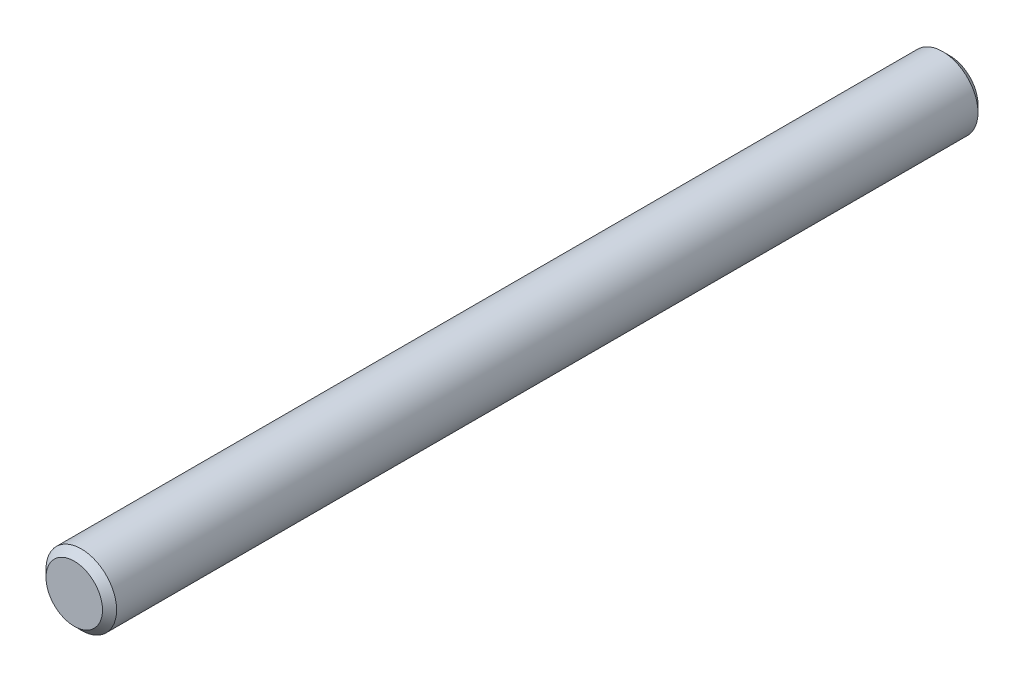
from build123d import *

# Parameters (mm, degrees)
ESQUISSE1_R          = 5
BASE_EXTRUSION_DEPTH = 124
CHANFREIN1_SIZE      = 1


with BuildPart() as part:
    # Esquisse1 → Base-Extrusion (new body)
    with BuildSketch(Plane.XY):
        Circle(ESQUISSE1_R)
    extrude(amount=BASE_EXTRUSION_DEPTH)

    # Chanfrein1
    chanfrein1_edges = [part.edges().sort_by_distance(p)[0] for p in [
        (-5, 0, 0),
        (-5, 0, 124),
    ]]
    chamfer(chanfrein1_edges, length=CHANFREIN1_SIZE)


solid = part.part
